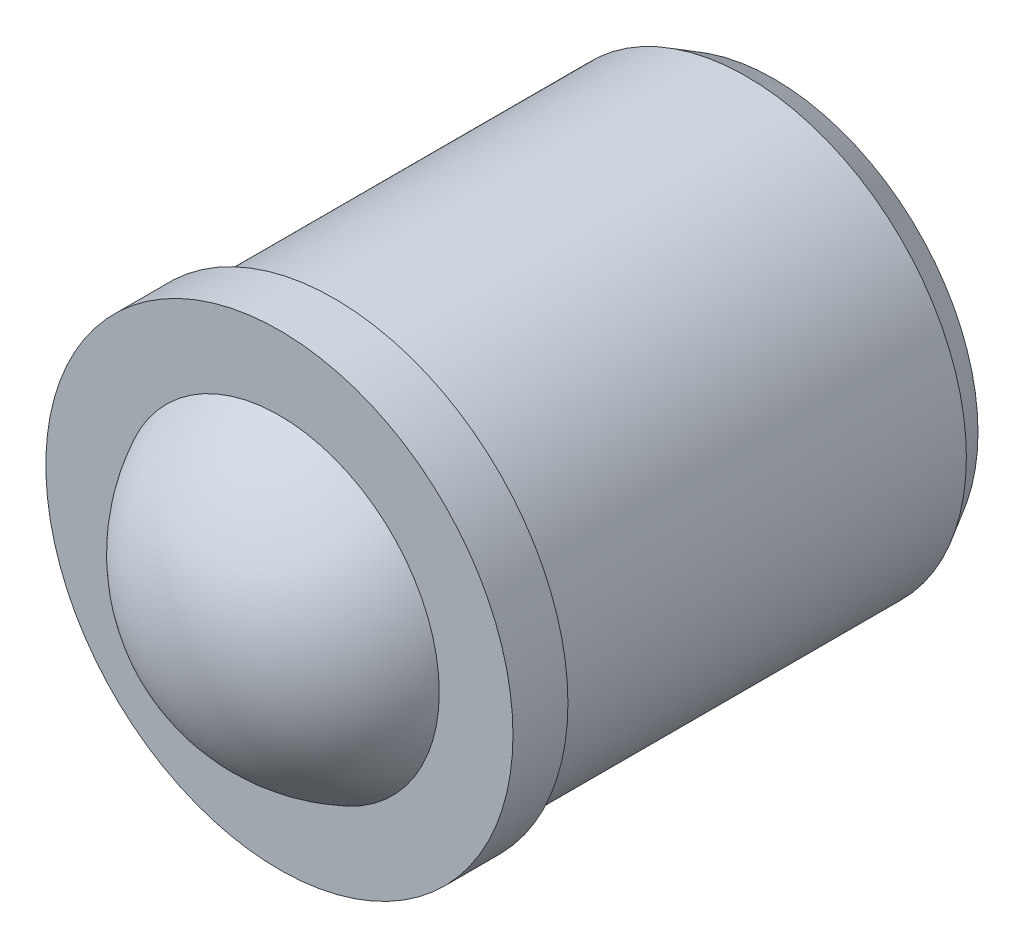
ISO-10303-21;
HEADER;
FILE_DESCRIPTION(('STEP AP214'),'2;1');
FILE_NAME('part.step','',(''),(''),'','','');
FILE_SCHEMA(('AUTOMOTIVE_DESIGN { 1 0 10303 214 1 1 1 1 }'));
ENDSEC;
DATA;
#1=APPLICATION_CONTEXT('core data for automotive mechanical design processes');
#2=APPLICATION_PROTOCOL_DEFINITION('international standard','automotive_design',2000,#1);
#3=PRODUCT_CONTEXT('',#1,'mechanical');
#4=PRODUCT('Part','Part','',(#3));
#5=PRODUCT_RELATED_PRODUCT_CATEGORY('part','',(#4));
#6=PRODUCT_DEFINITION_FORMATION('','',#4);
#7=PRODUCT_DEFINITION_CONTEXT('part definition',#1,'design');
#8=PRODUCT_DEFINITION('design','',#6,#7);
#9=PRODUCT_DEFINITION_SHAPE('','',#8);
#10=(LENGTH_UNIT() NAMED_UNIT(*) SI_UNIT(.MILLI.,.METRE.));
#11=(NAMED_UNIT(*) PLANE_ANGLE_UNIT() SI_UNIT($,.RADIAN.));
#12=(NAMED_UNIT(*) SI_UNIT($,.STERADIAN.) SOLID_ANGLE_UNIT());
#13=UNCERTAINTY_MEASURE_WITH_UNIT(LENGTH_MEASURE(1.E-05),#10,'distance_accuracy_value','');
#14=(GEOMETRIC_REPRESENTATION_CONTEXT(3) GLOBAL_UNCERTAINTY_ASSIGNED_CONTEXT((#13)) GLOBAL_UNIT_ASSIGNED_CONTEXT((#10,
#11,#12)) REPRESENTATION_CONTEXT('',''));
#15=CARTESIAN_POINT('',(0.,0.,0.));
#16=DIRECTION('',(0.,0.,1.));
#17=DIRECTION('',(1.,0.,0.));
#18=AXIS2_PLACEMENT_3D('',#15,#16,#17);
#19=CARTESIAN_POINT('',(0.,0.,-0.45));
#20=DIRECTION('',(1.,0.,0.));
#21=DIRECTION('',(0.,0.,-1.));
#22=AXIS2_PLACEMENT_3D('',#19,#20,#21);
#23=SPHERICAL_SURFACE('',#22,3.25);
#24=CARTESIAN_POINT('',(0.,0.,-0.45));
#25=DIRECTION('',(0.,0.,1.));
#26=DIRECTION('',(1.,0.,0.));
#27=AXIS2_PLACEMENT_3D('',#24,#25,#26);
#28=SPHERICAL_SURFACE('',#27,3.25);
#29=CARTESIAN_POINT('',(0.,0.,1.));
#30=DIRECTION('',(0.,0.,1.));
#31=DIRECTION('',(1.,0.,0.));
#32=AXIS2_PLACEMENT_3D('',#29,#30,#31);
#33=CIRCLE('',#32,2.9086079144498);
#34=CARTESIAN_POINT('',(2.9086079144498,0.,1.));
#35=VERTEX_POINT('',#34);
#36=EDGE_CURVE('E35',#35,#35,#33,.T.);
#37=ORIENTED_EDGE('',*,*,#36,.T.);
#38=EDGE_LOOP('',(#37));
#39=FACE_BOUND('',#38,.T.);
#40=ADVANCED_FACE('F12',(#39),#28,.T.);
#41=CARTESIAN_POINT('',(0.,0.,-8.));
#42=DIRECTION('',(0.,0.,1.));
#43=DIRECTION('',(1.,0.,0.));
#44=AXIS2_PLACEMENT_3D('',#41,#42,#43);
#45=PLANE('',#44);
#46=CARTESIAN_POINT('',(0.,0.,-8.));
#47=DIRECTION('',(0.,0.,1.));
#48=DIRECTION('',(1.,0.,0.));
#49=AXIS2_PLACEMENT_3D('',#46,#47,#48);
#50=CIRCLE('',#49,3.71132486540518);
#51=CARTESIAN_POINT('',(3.71132486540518,0.,-8.));
#52=VERTEX_POINT('',#51);
#53=EDGE_CURVE('E8',#52,#52,#50,.F.);
#54=ORIENTED_EDGE('',*,*,#53,.T.);
#55=EDGE_LOOP('',(#54));
#56=FACE_BOUND('',#55,.T.);
#57=ADVANCED_FACE('F60',(#56),#45,.F.);
#58=CARTESIAN_POINT('',(0.,0.,3.));
#59=DIRECTION('',(0.,0.,1.));
#60=DIRECTION('',(1.,0.,0.));
#61=AXIS2_PLACEMENT_3D('',#58,#59,#60);
#62=CYLINDRICAL_SURFACE('',#61,4.);
#63=CARTESIAN_POINT('',(0.,0.,-7.5));
#64=DIRECTION('',(0.,0.,1.));
#65=DIRECTION('',(1.,0.,0.));
#66=AXIS2_PLACEMENT_3D('',#63,#64,#65);
#67=CIRCLE('',#66,4.);
#68=CARTESIAN_POINT('',(4.,0.,-7.5));
#69=VERTEX_POINT('',#68);
#70=EDGE_CURVE('E19',#69,#69,#67,.T.);
#71=ORIENTED_EDGE('',*,*,#70,.T.);
#72=EDGE_LOOP('',(#71));
#73=FACE_BOUND('',#72,.T.);
#74=CARTESIAN_POINT('',(0.,0.,0.));
#75=DIRECTION('',(0.,0.,1.));
#76=DIRECTION('',(1.,0.,0.));
#77=AXIS2_PLACEMENT_3D('',#74,#75,#76);
#78=CIRCLE('',#77,4.);
#79=CARTESIAN_POINT('',(4.,0.,0.));
#80=VERTEX_POINT('',#79);
#81=EDGE_CURVE('E23',#80,#80,#78,.T.);
#82=ORIENTED_EDGE('',*,*,#81,.F.);
#83=EDGE_LOOP('',(#82));
#84=FACE_BOUND('',#83,.T.);
#85=ADVANCED_FACE('F55',(#73,#84),#62,.T.);
#86=CARTESIAN_POINT('',(0.,4.,0.));
#87=DIRECTION('',(0.,0.,1.));
#88=DIRECTION('',(1.,0.,0.));
#89=AXIS2_PLACEMENT_3D('',#86,#87,#88);
#90=PLANE('',#89);
#91=CARTESIAN_POINT('',(0.,0.,0.));
#92=DIRECTION('',(0.,0.,1.));
#93=DIRECTION('',(1.,0.,0.));
#94=AXIS2_PLACEMENT_3D('',#91,#92,#93);
#95=CIRCLE('',#94,4.25);
#96=CARTESIAN_POINT('',(4.25,0.,0.));
#97=VERTEX_POINT('',#96);
#98=EDGE_CURVE('E27',#97,#97,#95,.T.);
#99=ORIENTED_EDGE('',*,*,#98,.F.);
#100=EDGE_LOOP('',(#99));
#101=FACE_BOUND('',#100,.T.);
#102=ORIENTED_EDGE('',*,*,#81,.T.);
#103=EDGE_LOOP('',(#102));
#104=FACE_BOUND('',#103,.T.);
#105=ADVANCED_FACE('F49',(#101,#104),#90,.F.);
#106=CARTESIAN_POINT('',(0.,0.,3.));
#107=DIRECTION('',(0.,0.,1.));
#108=DIRECTION('',(1.,0.,0.));
#109=AXIS2_PLACEMENT_3D('',#106,#107,#108);
#110=CYLINDRICAL_SURFACE('',#109,4.25);
#111=CARTESIAN_POINT('',(0.,0.,1.));
#112=DIRECTION('',(0.,0.,1.));
#113=DIRECTION('',(1.,0.,0.));
#114=AXIS2_PLACEMENT_3D('',#111,#112,#113);
#115=CIRCLE('',#114,4.25);
#116=CARTESIAN_POINT('',(4.25,0.,1.));
#117=VERTEX_POINT('',#116);
#118=EDGE_CURVE('E32',#117,#117,#115,.T.);
#119=ORIENTED_EDGE('',*,*,#118,.F.);
#120=EDGE_LOOP('',(#119));
#121=FACE_BOUND('',#120,.T.);
#122=ORIENTED_EDGE('',*,*,#98,.T.);
#123=EDGE_LOOP('',(#122));
#124=FACE_BOUND('',#123,.T.);
#125=ADVANCED_FACE('F43',(#121,#124),#110,.T.);
#126=CARTESIAN_POINT('',(0.,4.25,1.));
#127=DIRECTION('',(0.,0.,-1.));
#128=DIRECTION('',(-1.,0.,0.));
#129=AXIS2_PLACEMENT_3D('',#126,#127,#128);
#130=PLANE('',#129);
#131=ORIENTED_EDGE('',*,*,#36,.F.);
#132=EDGE_LOOP('',(#131));
#133=FACE_BOUND('',#132,.T.);
#134=ORIENTED_EDGE('',*,*,#118,.T.);
#135=EDGE_LOOP('',(#134));
#136=FACE_BOUND('',#135,.T.);
#137=ADVANCED_FACE('F40',(#133,#136),#130,.F.);
#138=CARTESIAN_POINT('',(0.,0.,-7.5));
#139=DIRECTION('',(0.,0.,1.));
#140=DIRECTION('',(1.,0.,0.));
#141=AXIS2_PLACEMENT_3D('',#138,#139,#140);
#142=CONICAL_SURFACE('',#141,4.,0.523598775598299);
#143=ORIENTED_EDGE('',*,*,#53,.F.);
#144=EDGE_LOOP('',(#143));
#145=FACE_BOUND('',#144,.T.);
#146=ORIENTED_EDGE('',*,*,#70,.F.);
#147=EDGE_LOOP('',(#146));
#148=FACE_BOUND('',#147,.T.);
#149=ADVANCED_FACE('F14',(#145,#148),#142,.T.);
#150=CLOSED_SHELL('',(#40,#57,#85,#105,#125,#137,#149));
#151=MANIFOLD_SOLID_BREP('B1',#150);
#152=ADVANCED_BREP_SHAPE_REPRESENTATION('',(#18,#151),#14);
#153=SHAPE_DEFINITION_REPRESENTATION(#9,#152);
ENDSEC;
END-ISO-10303-21;
